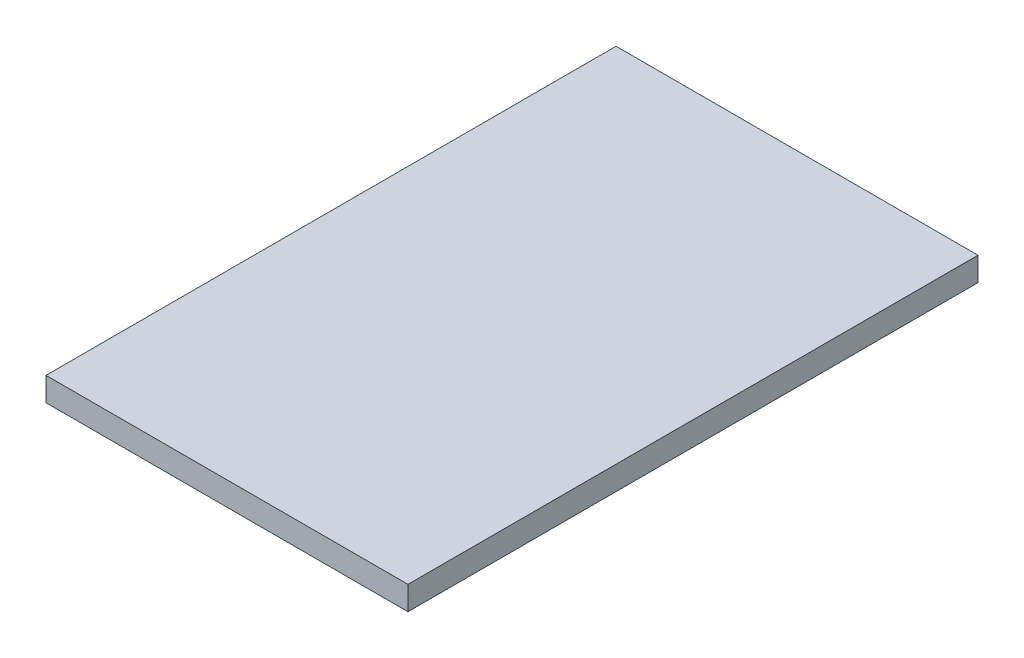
ISO-10303-21;
HEADER;
FILE_DESCRIPTION(('STEP AP214'),'2;1');
FILE_NAME('part.step','',(''),(''),'','','');
FILE_SCHEMA(('AUTOMOTIVE_DESIGN { 1 0 10303 214 1 1 1 1 }'));
ENDSEC;
DATA;
#1=APPLICATION_CONTEXT('core data for automotive mechanical design processes');
#2=APPLICATION_PROTOCOL_DEFINITION('international standard','automotive_design',2000,#1);
#3=PRODUCT_CONTEXT('',#1,'mechanical');
#4=PRODUCT('Part','Part','',(#3));
#5=PRODUCT_RELATED_PRODUCT_CATEGORY('part','',(#4));
#6=PRODUCT_DEFINITION_FORMATION('','',#4);
#7=PRODUCT_DEFINITION_CONTEXT('part definition',#1,'design');
#8=PRODUCT_DEFINITION('design','',#6,#7);
#9=PRODUCT_DEFINITION_SHAPE('','',#8);
#10=(LENGTH_UNIT() NAMED_UNIT(*) SI_UNIT(.MILLI.,.METRE.));
#11=(NAMED_UNIT(*) PLANE_ANGLE_UNIT() SI_UNIT($,.RADIAN.));
#12=(NAMED_UNIT(*) SI_UNIT($,.STERADIAN.) SOLID_ANGLE_UNIT());
#13=UNCERTAINTY_MEASURE_WITH_UNIT(LENGTH_MEASURE(1.E-05),#10,'distance_accuracy_value','');
#14=(GEOMETRIC_REPRESENTATION_CONTEXT(3) GLOBAL_UNCERTAINTY_ASSIGNED_CONTEXT((#13)) GLOBAL_UNIT_ASSIGNED_CONTEXT((#10,
#11,#12)) REPRESENTATION_CONTEXT('',''));
#15=CARTESIAN_POINT('',(0.,0.,0.));
#16=DIRECTION('',(0.,0.,1.));
#17=DIRECTION('',(1.,0.,0.));
#18=AXIS2_PLACEMENT_3D('',#15,#16,#17);
#19=CARTESIAN_POINT('',(-38.1,5.,60.));
#20=DIRECTION('',(1.,0.,0.));
#21=DIRECTION('',(0.,0.,-1.));
#22=AXIS2_PLACEMENT_3D('',#19,#20,#21);
#23=PLANE('',#22);
#24=DIRECTION('',(0.,0.,1.));
#25=VECTOR('',#24,1.);
#26=CARTESIAN_POINT('',(-38.1,0.,60.));
#27=LINE('',#26,#25);
#28=CARTESIAN_POINT('',(-38.1,0.,-60.));
#29=VERTEX_POINT('',#28);
#30=CARTESIAN_POINT('',(-38.1,0.,60.));
#31=VERTEX_POINT('',#30);
#32=EDGE_CURVE('E98',#29,#31,#27,.T.);
#33=ORIENTED_EDGE('',*,*,#32,.T.);
#34=DIRECTION('',(0.,-1.,0.));
#35=VECTOR('',#34,1.);
#36=CARTESIAN_POINT('',(-38.1,5.,60.));
#37=LINE('',#36,#35);
#38=CARTESIAN_POINT('',(-38.1,5.,60.));
#39=VERTEX_POINT('',#38);
#40=EDGE_CURVE('E11',#39,#31,#37,.T.);
#41=ORIENTED_EDGE('',*,*,#40,.F.);
#42=DIRECTION('',(0.,0.,1.));
#43=VECTOR('',#42,1.);
#44=CARTESIAN_POINT('',(-38.1,5.,60.));
#45=LINE('',#44,#43);
#46=CARTESIAN_POINT('',(-38.1,5.,-60.));
#47=VERTEX_POINT('',#46);
#48=EDGE_CURVE('E86',#47,#39,#45,.T.);
#49=ORIENTED_EDGE('',*,*,#48,.F.);
#50=DIRECTION('',(0.,-1.,0.));
#51=VECTOR('',#50,1.);
#52=CARTESIAN_POINT('',(-38.1,5.,-60.));
#53=LINE('',#52,#51);
#54=EDGE_CURVE('E94',#47,#29,#53,.T.);
#55=ORIENTED_EDGE('',*,*,#54,.T.);
#56=EDGE_LOOP('',(#33,#41,#49,#55));
#57=FACE_BOUND('',#56,.T.);
#58=ADVANCED_FACE('F35',(#57),#23,.F.);
#59=CARTESIAN_POINT('',(38.1,5.,60.));
#60=DIRECTION('',(0.,0.,-1.));
#61=DIRECTION('',(-1.,0.,0.));
#62=AXIS2_PLACEMENT_3D('',#59,#60,#61);
#63=PLANE('',#62);
#64=DIRECTION('',(1.,0.,0.));
#65=VECTOR('',#64,1.);
#66=CARTESIAN_POINT('',(38.1,0.,60.));
#67=LINE('',#66,#65);
#68=CARTESIAN_POINT('',(38.1,0.,60.));
#69=VERTEX_POINT('',#68);
#70=EDGE_CURVE('E90',#31,#69,#67,.T.);
#71=ORIENTED_EDGE('',*,*,#70,.T.);
#72=DIRECTION('',(0.,-1.,0.));
#73=VECTOR('',#72,1.);
#74=CARTESIAN_POINT('',(38.1,5.,60.));
#75=LINE('',#74,#73);
#76=CARTESIAN_POINT('',(38.1,5.,60.));
#77=VERTEX_POINT('',#76);
#78=EDGE_CURVE('E43',#77,#69,#75,.T.);
#79=ORIENTED_EDGE('',*,*,#78,.F.);
#80=DIRECTION('',(1.,0.,0.));
#81=VECTOR('',#80,1.);
#82=CARTESIAN_POINT('',(38.1,5.,60.));
#83=LINE('',#82,#81);
#84=EDGE_CURVE('E81',#39,#77,#83,.T.);
#85=ORIENTED_EDGE('',*,*,#84,.F.);
#86=ORIENTED_EDGE('',*,*,#40,.T.);
#87=EDGE_LOOP('',(#71,#79,#85,#86));
#88=FACE_BOUND('',#87,.T.);
#89=ADVANCED_FACE('F89',(#88),#63,.F.);
#90=CARTESIAN_POINT('',(38.1,5.,60.));
#91=DIRECTION('',(-1.,0.,0.));
#92=DIRECTION('',(0.,0.,1.));
#93=AXIS2_PLACEMENT_3D('',#90,#91,#92);
#94=PLANE('',#93);
#95=DIRECTION('',(0.,0.,-1.));
#96=VECTOR('',#95,1.);
#97=CARTESIAN_POINT('',(38.1,0.,60.));
#98=LINE('',#97,#96);
#99=CARTESIAN_POINT('',(38.1,0.,-60.));
#100=VERTEX_POINT('',#99);
#101=EDGE_CURVE('E68',#69,#100,#98,.T.);
#102=ORIENTED_EDGE('',*,*,#101,.T.);
#103=DIRECTION('',(0.,-1.,0.));
#104=VECTOR('',#103,1.);
#105=CARTESIAN_POINT('',(38.1,5.,-60.));
#106=LINE('',#105,#104);
#107=CARTESIAN_POINT('',(38.1,5.,-60.));
#108=VERTEX_POINT('',#107);
#109=EDGE_CURVE('E91',#108,#100,#106,.T.);
#110=ORIENTED_EDGE('',*,*,#109,.F.);
#111=DIRECTION('',(0.,0.,-1.));
#112=VECTOR('',#111,1.);
#113=CARTESIAN_POINT('',(38.1,5.,60.));
#114=LINE('',#113,#112);
#115=EDGE_CURVE('E84',#77,#108,#114,.T.);
#116=ORIENTED_EDGE('',*,*,#115,.F.);
#117=ORIENTED_EDGE('',*,*,#78,.T.);
#118=EDGE_LOOP('',(#102,#110,#116,#117));
#119=FACE_BOUND('',#118,.T.);
#120=ADVANCED_FACE('F92',(#119),#94,.F.);
#121=CARTESIAN_POINT('',(38.1,5.,-60.));
#122=DIRECTION('',(0.,0.,1.));
#123=DIRECTION('',(1.,0.,0.));
#124=AXIS2_PLACEMENT_3D('',#121,#122,#123);
#125=PLANE('',#124);
#126=DIRECTION('',(-1.,0.,0.));
#127=VECTOR('',#126,1.);
#128=CARTESIAN_POINT('',(38.1,0.,-60.));
#129=LINE('',#128,#127);
#130=EDGE_CURVE('E74',#100,#29,#129,.T.);
#131=ORIENTED_EDGE('',*,*,#130,.T.);
#132=ORIENTED_EDGE('',*,*,#54,.F.);
#133=DIRECTION('',(-1.,0.,0.));
#134=VECTOR('',#133,1.);
#135=CARTESIAN_POINT('',(38.1,5.,-60.));
#136=LINE('',#135,#134);
#137=EDGE_CURVE('E51',#108,#47,#136,.T.);
#138=ORIENTED_EDGE('',*,*,#137,.F.);
#139=ORIENTED_EDGE('',*,*,#109,.T.);
#140=EDGE_LOOP('',(#131,#132,#138,#139));
#141=FACE_BOUND('',#140,.T.);
#142=ADVANCED_FACE('F105',(#141),#125,.F.);
#143=CARTESIAN_POINT('',(0.,5.,0.));
#144=DIRECTION('',(0.,1.,0.));
#145=DIRECTION('',(0.,0.,1.));
#146=AXIS2_PLACEMENT_3D('',#143,#144,#145);
#147=PLANE('',#146);
#148=ORIENTED_EDGE('',*,*,#48,.T.);
#149=ORIENTED_EDGE('',*,*,#84,.T.);
#150=ORIENTED_EDGE('',*,*,#115,.T.);
#151=ORIENTED_EDGE('',*,*,#137,.T.);
#152=EDGE_LOOP('',(#148,#149,#150,#151));
#153=FACE_BOUND('',#152,.T.);
#154=ADVANCED_FACE('F82',(#153),#147,.T.);
#155=CARTESIAN_POINT('',(0.,0.,0.));
#156=DIRECTION('',(0.,1.,0.));
#157=DIRECTION('',(0.,0.,1.));
#158=AXIS2_PLACEMENT_3D('',#155,#156,#157);
#159=PLANE('',#158);
#160=ORIENTED_EDGE('',*,*,#32,.F.);
#161=ORIENTED_EDGE('',*,*,#130,.F.);
#162=ORIENTED_EDGE('',*,*,#101,.F.);
#163=ORIENTED_EDGE('',*,*,#70,.F.);
#164=EDGE_LOOP('',(#160,#161,#162,#163));
#165=FACE_BOUND('',#164,.T.);
#166=ADVANCED_FACE('F108',(#165),#159,.F.);
#167=CLOSED_SHELL('',(#58,#89,#120,#142,#154,#166));
#168=MANIFOLD_SOLID_BREP('B2',#167);
#169=ADVANCED_BREP_SHAPE_REPRESENTATION('',(#18,#168),#14);
#170=SHAPE_DEFINITION_REPRESENTATION(#9,#169);
ENDSEC;
END-ISO-10303-21;
